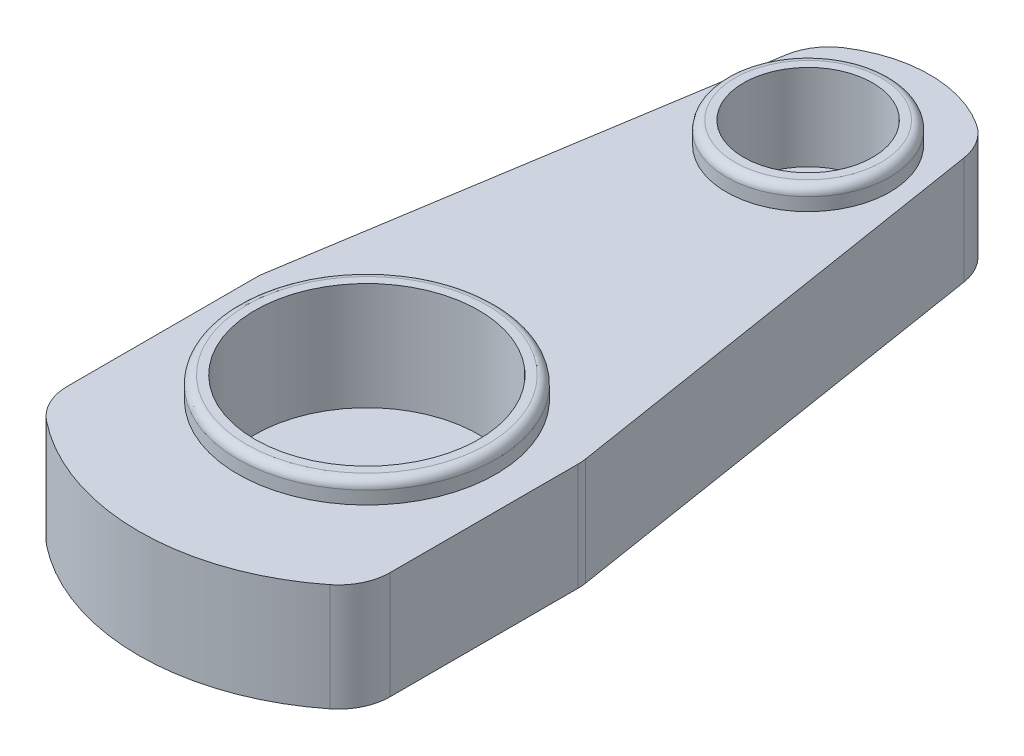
ISO-10303-21;
HEADER;
FILE_DESCRIPTION(('STEP AP214'),'2;1');
FILE_NAME('part.step','',(''),(''),'','','');
FILE_SCHEMA(('AUTOMOTIVE_DESIGN { 1 0 10303 214 1 1 1 1 }'));
ENDSEC;
DATA;
#1=APPLICATION_CONTEXT('core data for automotive mechanical design processes');
#2=APPLICATION_PROTOCOL_DEFINITION('international standard','automotive_design',2000,#1);
#3=PRODUCT_CONTEXT('',#1,'mechanical');
#4=PRODUCT('Part','Part','',(#3));
#5=PRODUCT_RELATED_PRODUCT_CATEGORY('part','',(#4));
#6=PRODUCT_DEFINITION_FORMATION('','',#4);
#7=PRODUCT_DEFINITION_CONTEXT('part definition',#1,'design');
#8=PRODUCT_DEFINITION('design','',#6,#7);
#9=PRODUCT_DEFINITION_SHAPE('','',#8);
#10=(LENGTH_UNIT() NAMED_UNIT(*) SI_UNIT(.MILLI.,.METRE.));
#11=(NAMED_UNIT(*) PLANE_ANGLE_UNIT() SI_UNIT($,.RADIAN.));
#12=(NAMED_UNIT(*) SI_UNIT($,.STERADIAN.) SOLID_ANGLE_UNIT());
#13=UNCERTAINTY_MEASURE_WITH_UNIT(LENGTH_MEASURE(1.E-05),#10,'distance_accuracy_value','');
#14=(GEOMETRIC_REPRESENTATION_CONTEXT(3) GLOBAL_UNCERTAINTY_ASSIGNED_CONTEXT((#13)) GLOBAL_UNIT_ASSIGNED_CONTEXT((#10,
#11,#12)) REPRESENTATION_CONTEXT('',''));
#15=CARTESIAN_POINT('',(0.,0.,0.));
#16=DIRECTION('',(0.,0.,1.));
#17=DIRECTION('',(1.,0.,0.));
#18=AXIS2_PLACEMENT_3D('',#15,#16,#17);
#19=CARTESIAN_POINT('',(0.,25.,37.546695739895));
#20=DIRECTION('',(0.,-1.,0.));
#21=DIRECTION('',(0.,0.,-1.));
#22=AXIS2_PLACEMENT_3D('',#19,#20,#21);
#23=CYLINDRICAL_SURFACE('',#22,53.);
#24=CARTESIAN_POINT('',(0.,25.,37.546695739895));
#25=DIRECTION('',(0.,1.,0.));
#26=DIRECTION('',(0.,0.,-1.));
#27=AXIS2_PLACEMENT_3D('',#24,#25,#26);
#28=CIRCLE('',#27,53.);
#29=CARTESIAN_POINT('',(-32.9634146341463,25.,79.0486631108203));
#30=VERTEX_POINT('',#29);
#31=CARTESIAN_POINT('',(32.9634146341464,25.,79.0486631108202));
#32=VERTEX_POINT('',#31);
#33=EDGE_CURVE('E156',#30,#32,#28,.T.);
#34=ORIENTED_EDGE('',*,*,#33,.F.);
#35=DIRECTION('',(0.,-1.,0.));
#36=VECTOR('',#35,1.);
#37=CARTESIAN_POINT('',(-32.9634146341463,25.,79.0486631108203));
#38=LINE('',#37,#36);
#39=CARTESIAN_POINT('',(-32.9634146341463,0.,79.0486631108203));
#40=VERTEX_POINT('',#39);
#41=EDGE_CURVE('E11',#30,#40,#38,.T.);
#42=ORIENTED_EDGE('',*,*,#41,.T.);
#43=CARTESIAN_POINT('',(0.,0.,37.546695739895));
#44=DIRECTION('',(0.,1.,0.));
#45=DIRECTION('',(0.,0.,-1.));
#46=AXIS2_PLACEMENT_3D('',#43,#44,#45);
#47=CIRCLE('',#46,53.);
#48=CARTESIAN_POINT('',(32.9634146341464,0.,79.0486631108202));
#49=VERTEX_POINT('',#48);
#50=EDGE_CURVE('E223',#40,#49,#47,.T.);
#51=ORIENTED_EDGE('',*,*,#50,.T.);
#52=DIRECTION('',(0.,-1.,0.));
#53=VECTOR('',#52,1.);
#54=CARTESIAN_POINT('',(32.9634146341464,25.,79.0486631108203));
#55=LINE('',#54,#53);
#56=EDGE_CURVE('E44',#49,#32,#55,.F.);
#57=ORIENTED_EDGE('',*,*,#56,.T.);
#58=EDGE_LOOP('',(#34,#42,#51,#57));
#59=FACE_BOUND('',#58,.T.);
#60=ADVANCED_FACE('F36',(#59),#23,.T.);
#61=CARTESIAN_POINT('',(37.5,25.,75.));
#62=DIRECTION('',(-1.,0.,0.));
#63=DIRECTION('',(0.,0.,1.));
#64=AXIS2_PLACEMENT_3D('',#61,#62,#63);
#65=PLANE('',#64);
#66=DIRECTION('',(0.,0.,-1.));
#67=VECTOR('',#66,1.);
#68=CARTESIAN_POINT('',(37.5,0.,75.));
#69=LINE('',#68,#67);
#70=CARTESIAN_POINT('',(37.5,0.,69.6519912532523));
#71=VERTEX_POINT('',#70);
#72=CARTESIAN_POINT('',(37.5,0.,25.9485808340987));
#73=VERTEX_POINT('',#72);
#74=EDGE_CURVE('E238',#71,#73,#69,.T.);
#75=ORIENTED_EDGE('',*,*,#74,.T.);
#76=DIRECTION('',(0.,-1.,0.));
#77=VECTOR('',#76,1.);
#78=CARTESIAN_POINT('',(37.5,25.,25.9485808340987));
#79=LINE('',#78,#77);
#80=CARTESIAN_POINT('',(37.5,25.,25.9485808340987));
#81=VERTEX_POINT('',#80);
#82=EDGE_CURVE('E211',#73,#81,#79,.F.);
#83=ORIENTED_EDGE('',*,*,#82,.T.);
#84=DIRECTION('',(0.,0.,-1.));
#85=VECTOR('',#84,1.);
#86=CARTESIAN_POINT('',(37.5,25.,75.));
#87=LINE('',#86,#85);
#88=CARTESIAN_POINT('',(37.5,25.,69.6519912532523));
#89=VERTEX_POINT('',#88);
#90=EDGE_CURVE('E231',#89,#81,#87,.T.);
#91=ORIENTED_EDGE('',*,*,#90,.F.);
#92=DIRECTION('',(0.,-1.,0.));
#93=VECTOR('',#92,1.);
#94=CARTESIAN_POINT('',(37.5,25.,69.6519912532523));
#95=LINE('',#94,#93);
#96=EDGE_CURVE('E208',#89,#71,#95,.T.);
#97=ORIENTED_EDGE('',*,*,#96,.T.);
#98=EDGE_LOOP('',(#75,#83,#91,#97));
#99=FACE_BOUND('',#98,.T.);
#100=ADVANCED_FACE('F237',(#99),#65,.F.);
#101=CARTESIAN_POINT('',(37.5,25.,25.));
#102=DIRECTION('',(-0.987580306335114,0.,0.157115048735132));
#103=DIRECTION('',(0.157115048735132,0.,0.987580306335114));
#104=AXIS2_PLACEMENT_3D('',#101,#102,#103);
#105=PLANE('',#104);
#106=DIRECTION('',(-0.157115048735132,0.,-0.987580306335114));
#107=VECTOR('',#106,1.);
#108=CARTESIAN_POINT('',(37.5,0.,25.));
#109=LINE('',#108,#107);
#110=CARTESIAN_POINT('',(37.3509636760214,0.,24.0632002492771));
#111=VERTEX_POINT('',#110);
#112=CARTESIAN_POINT('',(20.7078936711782,0.,-80.5503826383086));
#113=VERTEX_POINT('',#112);
#114=EDGE_CURVE('E158',#111,#113,#109,.T.);
#115=ORIENTED_EDGE('',*,*,#114,.T.);
#116=DIRECTION('',(0.,-1.,0.));
#117=VECTOR('',#116,1.);
#118=CARTESIAN_POINT('',(20.7078936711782,25.,-80.5503826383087));
#119=LINE('',#118,#117);
#120=CARTESIAN_POINT('',(20.7078936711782,25.,-80.5503826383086));
#121=VERTEX_POINT('',#120);
#122=EDGE_CURVE('E206',#113,#121,#119,.F.);
#123=ORIENTED_EDGE('',*,*,#122,.T.);
#124=DIRECTION('',(-0.157115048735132,0.,-0.987580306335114));
#125=VECTOR('',#124,1.);
#126=CARTESIAN_POINT('',(37.5,25.,25.));
#127=LINE('',#126,#125);
#128=CARTESIAN_POINT('',(37.3509636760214,25.,24.0632002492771));
#129=VERTEX_POINT('',#128);
#130=EDGE_CURVE('E250',#129,#121,#127,.T.);
#131=ORIENTED_EDGE('',*,*,#130,.F.);
#132=DIRECTION('',(0.,-1.,0.));
#133=VECTOR('',#132,1.);
#134=CARTESIAN_POINT('',(37.3509636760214,25.,24.0632002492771));
#135=LINE('',#134,#133);
#136=EDGE_CURVE('E203',#129,#111,#135,.T.);
#137=ORIENTED_EDGE('',*,*,#136,.T.);
#138=EDGE_LOOP('',(#115,#123,#131,#137));
#139=FACE_BOUND('',#138,.T.);
#140=ADVANCED_FACE('F290',(#139),#105,.F.);
#141=CARTESIAN_POINT('',(0.,25.,-64.9999999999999));
#142=DIRECTION('',(0.,-1.,0.));
#143=DIRECTION('',(0.,0.,-1.));
#144=AXIS2_PLACEMENT_3D('',#141,#142,#143);
#145=CYLINDRICAL_SURFACE('',#144,28.284271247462);
#146=CARTESIAN_POINT('',(0.,0.,-64.9999999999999));
#147=DIRECTION('',(0.,1.,0.));
#148=DIRECTION('',(0.,0.,1.));
#149=AXIS2_PLACEMENT_3D('',#146,#147,#148);
#150=CIRCLE('',#149,28.284271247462);
#151=CARTESIAN_POINT('',(15.3836672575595,0.,-88.7348431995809));
#152=VERTEX_POINT('',#151);
#153=CARTESIAN_POINT('',(-15.3836672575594,0.,-88.7348431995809));
#154=VERTEX_POINT('',#153);
#155=EDGE_CURVE('E154',#152,#154,#150,.T.);
#156=ORIENTED_EDGE('',*,*,#155,.T.);
#157=DIRECTION('',(0.,-1.,0.));
#158=VECTOR('',#157,1.);
#159=CARTESIAN_POINT('',(-15.3836672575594,25.,-88.7348431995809));
#160=LINE('',#159,#158);
#161=CARTESIAN_POINT('',(-15.3836672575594,25.,-88.7348431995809));
#162=VERTEX_POINT('',#161);
#163=EDGE_CURVE('E132',#154,#162,#160,.F.);
#164=ORIENTED_EDGE('',*,*,#163,.T.);
#165=CARTESIAN_POINT('',(0.,25.,-64.9999999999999));
#166=DIRECTION('',(0.,1.,0.));
#167=DIRECTION('',(0.,0.,1.));
#168=AXIS2_PLACEMENT_3D('',#165,#166,#167);
#169=CIRCLE('',#168,28.284271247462);
#170=CARTESIAN_POINT('',(15.3836672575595,25.,-88.7348431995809));
#171=VERTEX_POINT('',#170);
#172=EDGE_CURVE('E248',#171,#162,#169,.T.);
#173=ORIENTED_EDGE('',*,*,#172,.F.);
#174=DIRECTION('',(0.,-1.,0.));
#175=VECTOR('',#174,1.);
#176=CARTESIAN_POINT('',(15.3836672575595,25.,-88.7348431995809));
#177=LINE('',#176,#175);
#178=EDGE_CURVE('E137',#171,#152,#177,.T.);
#179=ORIENTED_EDGE('',*,*,#178,.T.);
#180=EDGE_LOOP('',(#156,#164,#173,#179));
#181=FACE_BOUND('',#180,.T.);
#182=ADVANCED_FACE('F327',(#181),#145,.T.);
#183=CARTESIAN_POINT('',(-37.5,25.,25.));
#184=DIRECTION('',(0.987580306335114,0.,0.157115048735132));
#185=DIRECTION('',(0.157115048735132,0.,-0.987580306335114));
#186=AXIS2_PLACEMENT_3D('',#183,#184,#185);
#187=PLANE('',#186);
#188=DIRECTION('',(-0.157115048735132,0.,0.987580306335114));
#189=VECTOR('',#188,1.);
#190=CARTESIAN_POINT('',(-37.5,25.,25.));
#191=LINE('',#190,#189);
#192=CARTESIAN_POINT('',(-20.7078936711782,25.,-80.5503826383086));
#193=VERTEX_POINT('',#192);
#194=CARTESIAN_POINT('',(-37.3509636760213,25.,24.0632002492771));
#195=VERTEX_POINT('',#194);
#196=EDGE_CURVE('E146',#193,#195,#191,.T.);
#197=ORIENTED_EDGE('',*,*,#196,.F.);
#198=DIRECTION('',(0.,-1.,0.));
#199=VECTOR('',#198,1.);
#200=CARTESIAN_POINT('',(-20.7078936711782,25.,-80.5503826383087));
#201=LINE('',#200,#199);
#202=CARTESIAN_POINT('',(-20.7078936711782,0.,-80.5503826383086));
#203=VERTEX_POINT('',#202);
#204=EDGE_CURVE('E131',#193,#203,#201,.T.);
#205=ORIENTED_EDGE('',*,*,#204,.T.);
#206=DIRECTION('',(-0.157115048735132,0.,0.987580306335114));
#207=VECTOR('',#206,1.);
#208=CARTESIAN_POINT('',(-37.5,0.,25.));
#209=LINE('',#208,#207);
#210=CARTESIAN_POINT('',(-37.3509636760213,0.,24.0632002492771));
#211=VERTEX_POINT('',#210);
#212=EDGE_CURVE('E144',#203,#211,#209,.T.);
#213=ORIENTED_EDGE('',*,*,#212,.T.);
#214=DIRECTION('',(0.,-1.,0.));
#215=VECTOR('',#214,1.);
#216=CARTESIAN_POINT('',(-37.3509636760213,25.,24.0632002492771));
#217=LINE('',#216,#215);
#218=EDGE_CURVE('E148',#211,#195,#217,.F.);
#219=ORIENTED_EDGE('',*,*,#218,.T.);
#220=EDGE_LOOP('',(#197,#205,#213,#219));
#221=FACE_BOUND('',#220,.T.);
#222=ADVANCED_FACE('F143',(#221),#187,.F.);
#223=CARTESIAN_POINT('',(-37.5,25.,75.));
#224=DIRECTION('',(1.,0.,0.));
#225=DIRECTION('',(0.,0.,-1.));
#226=AXIS2_PLACEMENT_3D('',#223,#224,#225);
#227=PLANE('',#226);
#228=DIRECTION('',(0.,0.,1.));
#229=VECTOR('',#228,1.);
#230=CARTESIAN_POINT('',(-37.5,25.,75.));
#231=LINE('',#230,#229);
#232=CARTESIAN_POINT('',(-37.5,25.,25.9485808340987));
#233=VERTEX_POINT('',#232);
#234=CARTESIAN_POINT('',(-37.5,25.,69.6519912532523));
#235=VERTEX_POINT('',#234);
#236=EDGE_CURVE('E166',#233,#235,#231,.T.);
#237=ORIENTED_EDGE('',*,*,#236,.F.);
#238=DIRECTION('',(0.,-1.,0.));
#239=VECTOR('',#238,1.);
#240=CARTESIAN_POINT('',(-37.5,25.,25.9485808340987));
#241=LINE('',#240,#239);
#242=CARTESIAN_POINT('',(-37.5,0.,25.9485808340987));
#243=VERTEX_POINT('',#242);
#244=EDGE_CURVE('E214',#233,#243,#241,.T.);
#245=ORIENTED_EDGE('',*,*,#244,.T.);
#246=DIRECTION('',(0.,0.,1.));
#247=VECTOR('',#246,1.);
#248=CARTESIAN_POINT('',(-37.5,0.,75.));
#249=LINE('',#248,#247);
#250=CARTESIAN_POINT('',(-37.5,0.,69.6519912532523));
#251=VERTEX_POINT('',#250);
#252=EDGE_CURVE('E153',#243,#251,#249,.T.);
#253=ORIENTED_EDGE('',*,*,#252,.T.);
#254=DIRECTION('',(0.,-1.,0.));
#255=VECTOR('',#254,1.);
#256=CARTESIAN_POINT('',(-37.5,25.,69.6519912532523));
#257=LINE('',#256,#255);
#258=EDGE_CURVE('E51',#251,#235,#257,.F.);
#259=ORIENTED_EDGE('',*,*,#258,.T.);
#260=EDGE_LOOP('',(#237,#245,#253,#259));
#261=FACE_BOUND('',#260,.T.);
#262=ADVANCED_FACE('F321',(#261),#227,.F.);
#263=CARTESIAN_POINT('',(0.,25.,37.546695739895));
#264=DIRECTION('',(0.,-1.,0.));
#265=DIRECTION('',(0.,0.,-1.));
#266=AXIS2_PLACEMENT_3D('',#263,#264,#265);
#267=PLANE('',#266);
#268=CARTESIAN_POINT('',(0.,25.,-64.9999999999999));
#269=DIRECTION('',(0.,-1.,0.));
#270=DIRECTION('',(0.,0.,-1.));
#271=AXIS2_PLACEMENT_3D('',#268,#269,#270);
#272=CIRCLE('',#271,19.);
#273=CARTESIAN_POINT('',(0.,25.,-83.9999999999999));
#274=VERTEX_POINT('',#273);
#275=EDGE_CURVE('E172',#274,#274,#272,.F.);
#276=ORIENTED_EDGE('',*,*,#275,.F.);
#277=EDGE_LOOP('',(#276));
#278=FACE_BOUND('',#277,.T.);
#279=CARTESIAN_POINT('',(0.,25.,37.546695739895));
#280=DIRECTION('',(0.,-1.,0.));
#281=DIRECTION('',(0.,0.,-1.));
#282=AXIS2_PLACEMENT_3D('',#279,#280,#281);
#283=CIRCLE('',#282,30.);
#284=CARTESIAN_POINT('',(0.,25.,7.54669573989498));
#285=VERTEX_POINT('',#284);
#286=EDGE_CURVE('E162',#285,#285,#283,.F.);
#287=ORIENTED_EDGE('',*,*,#286,.F.);
#288=EDGE_LOOP('',(#287));
#289=FACE_BOUND('',#288,.T.);
#290=ORIENTED_EDGE('',*,*,#172,.T.);
#291=CARTESIAN_POINT('',(-8.85692999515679,25.,-78.6650020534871));
#292=DIRECTION('',(0.,-1.,0.));
#293=DIRECTION('',(0.,0.,-1.));
#294=AXIS2_PLACEMENT_3D('',#291,#292,#293);
#295=CIRCLE('',#294,12.);
#296=EDGE_CURVE('E201',#162,#193,#295,.F.);
#297=ORIENTED_EDGE('',*,*,#296,.T.);
#298=ORIENTED_EDGE('',*,*,#196,.T.);
#299=CARTESIAN_POINT('',(-25.5,25.,25.9485808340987));
#300=DIRECTION('',(0.,-1.,0.));
#301=DIRECTION('',(0.,0.,-1.));
#302=AXIS2_PLACEMENT_3D('',#299,#300,#301);
#303=CIRCLE('',#302,12.);
#304=EDGE_CURVE('E58',#195,#233,#303,.F.);
#305=ORIENTED_EDGE('',*,*,#304,.T.);
#306=ORIENTED_EDGE('',*,*,#236,.T.);
#307=CARTESIAN_POINT('',(-25.5,25.,69.6519912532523));
#308=DIRECTION('',(0.,-1.,0.));
#309=DIRECTION('',(0.,0.,-1.));
#310=AXIS2_PLACEMENT_3D('',#307,#308,#309);
#311=CIRCLE('',#310,12.);
#312=EDGE_CURVE('E194',#235,#30,#311,.F.);
#313=ORIENTED_EDGE('',*,*,#312,.T.);
#314=ORIENTED_EDGE('',*,*,#33,.T.);
#315=CARTESIAN_POINT('',(25.5,25.,69.6519912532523));
#316=DIRECTION('',(0.,-1.,0.));
#317=DIRECTION('',(0.,0.,-1.));
#318=AXIS2_PLACEMENT_3D('',#315,#316,#317);
#319=CIRCLE('',#318,12.);
#320=EDGE_CURVE('E192',#32,#89,#319,.F.);
#321=ORIENTED_EDGE('',*,*,#320,.T.);
#322=ORIENTED_EDGE('',*,*,#90,.T.);
#323=CARTESIAN_POINT('',(25.5,25.,25.9485808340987));
#324=DIRECTION('',(0.,-1.,0.));
#325=DIRECTION('',(0.,0.,-1.));
#326=AXIS2_PLACEMENT_3D('',#323,#324,#325);
#327=CIRCLE('',#326,12.);
#328=EDGE_CURVE('E197',#81,#129,#327,.F.);
#329=ORIENTED_EDGE('',*,*,#328,.T.);
#330=ORIENTED_EDGE('',*,*,#130,.T.);
#331=CARTESIAN_POINT('',(8.85692999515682,25.,-78.6650020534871));
#332=DIRECTION('',(0.,-1.,0.));
#333=DIRECTION('',(0.,0.,-1.));
#334=AXIS2_PLACEMENT_3D('',#331,#332,#333);
#335=CIRCLE('',#334,12.);
#336=EDGE_CURVE('E199',#121,#171,#335,.F.);
#337=ORIENTED_EDGE('',*,*,#336,.T.);
#338=EDGE_LOOP('',(#290,#297,#298,#305,#306,#313,#314,#321,#322,#329,#330,#337));
#339=FACE_BOUND('',#338,.T.);
#340=ADVANCED_FACE('F227',(#278,#289,#339),#267,.F.);
#341=CARTESIAN_POINT('',(0.,0.,37.546695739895));
#342=DIRECTION('',(0.,-1.,0.));
#343=DIRECTION('',(0.,0.,-1.));
#344=AXIS2_PLACEMENT_3D('',#341,#342,#343);
#345=PLANE('',#344);
#346=ORIENTED_EDGE('',*,*,#212,.F.);
#347=CARTESIAN_POINT('',(-8.85692999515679,0.,-78.6650020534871));
#348=DIRECTION('',(0.,-1.,0.));
#349=DIRECTION('',(0.,0.,-1.));
#350=AXIS2_PLACEMENT_3D('',#347,#348,#349);
#351=CIRCLE('',#350,12.);
#352=EDGE_CURVE('E127',#203,#154,#351,.T.);
#353=ORIENTED_EDGE('',*,*,#352,.T.);
#354=ORIENTED_EDGE('',*,*,#155,.F.);
#355=CARTESIAN_POINT('',(8.85692999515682,0.,-78.6650020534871));
#356=DIRECTION('',(0.,-1.,0.));
#357=DIRECTION('',(0.,0.,-1.));
#358=AXIS2_PLACEMENT_3D('',#355,#356,#357);
#359=CIRCLE('',#358,12.);
#360=EDGE_CURVE('E138',#152,#113,#359,.T.);
#361=ORIENTED_EDGE('',*,*,#360,.T.);
#362=ORIENTED_EDGE('',*,*,#114,.F.);
#363=CARTESIAN_POINT('',(25.5,0.,25.9485808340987));
#364=DIRECTION('',(0.,-1.,0.));
#365=DIRECTION('',(0.,0.,-1.));
#366=AXIS2_PLACEMENT_3D('',#363,#364,#365);
#367=CIRCLE('',#366,12.);
#368=EDGE_CURVE('E186',#111,#73,#367,.T.);
#369=ORIENTED_EDGE('',*,*,#368,.T.);
#370=ORIENTED_EDGE('',*,*,#74,.F.);
#371=CARTESIAN_POINT('',(25.5,0.,69.6519912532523));
#372=DIRECTION('',(0.,-1.,0.));
#373=DIRECTION('',(0.,0.,-1.));
#374=AXIS2_PLACEMENT_3D('',#371,#372,#373);
#375=CIRCLE('',#374,12.);
#376=EDGE_CURVE('E147',#71,#49,#375,.T.);
#377=ORIENTED_EDGE('',*,*,#376,.T.);
#378=ORIENTED_EDGE('',*,*,#50,.F.);
#379=CARTESIAN_POINT('',(-25.5,0.,69.6519912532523));
#380=DIRECTION('',(0.,-1.,0.));
#381=DIRECTION('',(0.,0.,-1.));
#382=AXIS2_PLACEMENT_3D('',#379,#380,#381);
#383=CIRCLE('',#382,12.);
#384=EDGE_CURVE('E183',#40,#251,#383,.T.);
#385=ORIENTED_EDGE('',*,*,#384,.T.);
#386=ORIENTED_EDGE('',*,*,#252,.F.);
#387=CARTESIAN_POINT('',(-25.5,0.,25.9485808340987));
#388=DIRECTION('',(0.,-1.,0.));
#389=DIRECTION('',(0.,0.,-1.));
#390=AXIS2_PLACEMENT_3D('',#387,#388,#389);
#391=CIRCLE('',#390,12.);
#392=EDGE_CURVE('E152',#243,#211,#391,.T.);
#393=ORIENTED_EDGE('',*,*,#392,.T.);
#394=EDGE_LOOP('',(#346,#353,#354,#361,#362,#369,#370,#377,#378,#385,#386,#393));
#395=FACE_BOUND('',#394,.T.);
#396=ADVANCED_FACE('F150',(#395),#345,.T.);
#397=CARTESIAN_POINT('',(0.,30.,37.546695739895));
#398=DIRECTION('',(0.,-1.,0.));
#399=DIRECTION('',(0.,0.,-1.));
#400=AXIS2_PLACEMENT_3D('',#397,#398,#399);
#401=CYLINDRICAL_SURFACE('',#400,30.);
#402=CARTESIAN_POINT('',(0.,28.,37.546695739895));
#403=DIRECTION('',(0.,1.,0.));
#404=DIRECTION('',(0.,0.,1.));
#405=AXIS2_PLACEMENT_3D('',#402,#403,#404);
#406=CIRCLE('',#405,30.);
#407=CARTESIAN_POINT('',(0.,28.,67.546695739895));
#408=VERTEX_POINT('',#407);
#409=EDGE_CURVE('E169',#408,#408,#406,.F.);
#410=ORIENTED_EDGE('',*,*,#409,.T.);
#411=EDGE_LOOP('',(#410));
#412=FACE_BOUND('',#411,.T.);
#413=ORIENTED_EDGE('',*,*,#286,.T.);
#414=EDGE_LOOP('',(#413));
#415=FACE_BOUND('',#414,.T.);
#416=ADVANCED_FACE('F345',(#412,#415),#401,.T.);
#417=CARTESIAN_POINT('',(0.,30.,37.546695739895));
#418=DIRECTION('',(0.,1.,0.));
#419=DIRECTION('',(0.,0.,1.));
#420=AXIS2_PLACEMENT_3D('',#417,#418,#419);
#421=PLANE('',#420);
#422=CARTESIAN_POINT('',(0.,30.,37.546695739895));
#423=DIRECTION('',(0.,1.,0.));
#424=DIRECTION('',(0.,0.,1.));
#425=AXIS2_PLACEMENT_3D('',#422,#423,#424);
#426=CIRCLE('',#425,28.);
#427=CARTESIAN_POINT('',(0.,30.,65.546695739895));
#428=VERTEX_POINT('',#427);
#429=EDGE_CURVE('E165',#428,#428,#426,.T.);
#430=ORIENTED_EDGE('',*,*,#429,.T.);
#431=EDGE_LOOP('',(#430));
#432=FACE_BOUND('',#431,.T.);
#433=CARTESIAN_POINT('',(0.,30.,37.546695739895));
#434=DIRECTION('',(0.,1.,0.));
#435=DIRECTION('',(0.,0.,1.));
#436=AXIS2_PLACEMENT_3D('',#433,#434,#435);
#437=CIRCLE('',#436,26.);
#438=CARTESIAN_POINT('',(0.,30.,63.546695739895));
#439=VERTEX_POINT('',#438);
#440=EDGE_CURVE('E254',#439,#439,#437,.T.);
#441=ORIENTED_EDGE('',*,*,#440,.F.);
#442=EDGE_LOOP('',(#441));
#443=FACE_BOUND('',#442,.T.);
#444=ADVANCED_FACE('F351',(#432,#443),#421,.T.);
#445=CARTESIAN_POINT('',(0.,5.,37.546695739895));
#446=DIRECTION('',(0.,1.,0.));
#447=DIRECTION('',(0.,0.,1.));
#448=AXIS2_PLACEMENT_3D('',#445,#446,#447);
#449=CYLINDRICAL_SURFACE('',#448,26.);
#450=CARTESIAN_POINT('',(0.,5.,37.546695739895));
#451=DIRECTION('',(0.,1.,0.));
#452=DIRECTION('',(0.,0.,1.));
#453=AXIS2_PLACEMENT_3D('',#450,#451,#452);
#454=CIRCLE('',#453,26.);
#455=CARTESIAN_POINT('',(0.,5.,63.546695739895));
#456=VERTEX_POINT('',#455);
#457=EDGE_CURVE('E243',#456,#456,#454,.T.);
#458=ORIENTED_EDGE('',*,*,#457,.F.);
#459=EDGE_LOOP('',(#458));
#460=FACE_BOUND('',#459,.T.);
#461=ORIENTED_EDGE('',*,*,#440,.T.);
#462=EDGE_LOOP('',(#461));
#463=FACE_BOUND('',#462,.T.);
#464=ADVANCED_FACE('F355',(#460,#463),#449,.F.);
#465=CARTESIAN_POINT('',(0.,5.,37.546695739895));
#466=DIRECTION('',(0.,1.,0.));
#467=DIRECTION('',(0.,0.,1.));
#468=AXIS2_PLACEMENT_3D('',#465,#466,#467);
#469=PLANE('',#468);
#470=ORIENTED_EDGE('',*,*,#457,.T.);
#471=EDGE_LOOP('',(#470));
#472=FACE_BOUND('',#471,.T.);
#473=ADVANCED_FACE('F296',(#472),#469,.T.);
#474=CARTESIAN_POINT('',(0.,28.,37.546695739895));
#475=DIRECTION('',(0.,1.,0.));
#476=DIRECTION('',(0.,0.,1.));
#477=AXIS2_PLACEMENT_3D('',#474,#475,#476);
#478=TOROIDAL_SURFACE('',#477,28.,2.);
#479=ORIENTED_EDGE('',*,*,#409,.F.);
#480=EDGE_LOOP('',(#479));
#481=FACE_BOUND('',#480,.T.);
#482=ORIENTED_EDGE('',*,*,#429,.F.);
#483=EDGE_LOOP('',(#482));
#484=FACE_BOUND('',#483,.T.);
#485=ADVANCED_FACE('F282',(#481,#484),#478,.T.);
#486=CARTESIAN_POINT('',(0.,30.,-64.9999999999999));
#487=DIRECTION('',(0.,-1.,0.));
#488=DIRECTION('',(0.,0.,-1.));
#489=AXIS2_PLACEMENT_3D('',#486,#487,#488);
#490=CYLINDRICAL_SURFACE('',#489,19.);
#491=CARTESIAN_POINT('',(0.,28.,-64.9999999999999));
#492=DIRECTION('',(0.,1.,0.));
#493=DIRECTION('',(0.,0.,1.));
#494=AXIS2_PLACEMENT_3D('',#491,#492,#493);
#495=CIRCLE('',#494,19.);
#496=CARTESIAN_POINT('',(0.,28.,-45.9999999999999));
#497=VERTEX_POINT('',#496);
#498=EDGE_CURVE('E178',#497,#497,#495,.F.);
#499=ORIENTED_EDGE('',*,*,#498,.T.);
#500=EDGE_LOOP('',(#499));
#501=FACE_BOUND('',#500,.T.);
#502=ORIENTED_EDGE('',*,*,#275,.T.);
#503=EDGE_LOOP('',(#502));
#504=FACE_BOUND('',#503,.T.);
#505=ADVANCED_FACE('F276',(#501,#504),#490,.T.);
#506=CARTESIAN_POINT('',(0.,30.,-64.9999999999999));
#507=DIRECTION('',(0.,1.,0.));
#508=DIRECTION('',(0.,0.,1.));
#509=AXIS2_PLACEMENT_3D('',#506,#507,#508);
#510=PLANE('',#509);
#511=CARTESIAN_POINT('',(0.,30.,-64.9999999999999));
#512=DIRECTION('',(0.,1.,0.));
#513=DIRECTION('',(0.,0.,1.));
#514=AXIS2_PLACEMENT_3D('',#511,#512,#513);
#515=CIRCLE('',#514,17.);
#516=CARTESIAN_POINT('',(0.,30.,-47.9999999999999));
#517=VERTEX_POINT('',#516);
#518=EDGE_CURVE('E175',#517,#517,#515,.T.);
#519=ORIENTED_EDGE('',*,*,#518,.T.);
#520=EDGE_LOOP('',(#519));
#521=FACE_BOUND('',#520,.T.);
#522=CARTESIAN_POINT('',(0.,30.,-64.9999999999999));
#523=DIRECTION('',(0.,1.,0.));
#524=DIRECTION('',(0.,0.,1.));
#525=AXIS2_PLACEMENT_3D('',#522,#523,#524);
#526=CIRCLE('',#525,15.);
#527=CARTESIAN_POINT('',(0.,30.,-49.9999999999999));
#528=VERTEX_POINT('',#527);
#529=EDGE_CURVE('E260',#528,#528,#526,.T.);
#530=ORIENTED_EDGE('',*,*,#529,.F.);
#531=EDGE_LOOP('',(#530));
#532=FACE_BOUND('',#531,.T.);
#533=ADVANCED_FACE('F271',(#521,#532),#510,.T.);
#534=CARTESIAN_POINT('',(0.,10.,-64.9999999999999));
#535=DIRECTION('',(0.,1.,0.));
#536=DIRECTION('',(0.,0.,1.));
#537=AXIS2_PLACEMENT_3D('',#534,#535,#536);
#538=CYLINDRICAL_SURFACE('',#537,15.);
#539=CARTESIAN_POINT('',(0.,10.,-64.9999999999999));
#540=DIRECTION('',(0.,1.,0.));
#541=DIRECTION('',(0.,0.,1.));
#542=AXIS2_PLACEMENT_3D('',#539,#540,#541);
#543=CIRCLE('',#542,15.);
#544=CARTESIAN_POINT('',(0.,10.,-49.9999999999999));
#545=VERTEX_POINT('',#544);
#546=EDGE_CURVE('E257',#545,#545,#543,.T.);
#547=ORIENTED_EDGE('',*,*,#546,.F.);
#548=EDGE_LOOP('',(#547));
#549=FACE_BOUND('',#548,.T.);
#550=ORIENTED_EDGE('',*,*,#529,.T.);
#551=EDGE_LOOP('',(#550));
#552=FACE_BOUND('',#551,.T.);
#553=ADVANCED_FACE('F268',(#549,#552),#538,.F.);
#554=CARTESIAN_POINT('',(0.,10.,-64.9999999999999));
#555=DIRECTION('',(0.,1.,0.));
#556=DIRECTION('',(0.,0.,1.));
#557=AXIS2_PLACEMENT_3D('',#554,#555,#556);
#558=PLANE('',#557);
#559=ORIENTED_EDGE('',*,*,#546,.T.);
#560=EDGE_LOOP('',(#559));
#561=FACE_BOUND('',#560,.T.);
#562=ADVANCED_FACE('F266',(#561),#558,.T.);
#563=CARTESIAN_POINT('',(0.,28.,-64.9999999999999));
#564=DIRECTION('',(0.,1.,0.));
#565=DIRECTION('',(0.,0.,1.));
#566=AXIS2_PLACEMENT_3D('',#563,#564,#565);
#567=TOROIDAL_SURFACE('',#566,17.,2.);
#568=ORIENTED_EDGE('',*,*,#498,.F.);
#569=EDGE_LOOP('',(#568));
#570=FACE_BOUND('',#569,.T.);
#571=ORIENTED_EDGE('',*,*,#518,.F.);
#572=EDGE_LOOP('',(#571));
#573=FACE_BOUND('',#572,.T.);
#574=ADVANCED_FACE('F298',(#570,#573),#567,.T.);
#575=CARTESIAN_POINT('',(-8.85692999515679,25.,-78.6650020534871));
#576=DIRECTION('',(0.,-1.,0.));
#577=DIRECTION('',(0.,0.,-1.));
#578=AXIS2_PLACEMENT_3D('',#575,#576,#577);
#579=CYLINDRICAL_SURFACE('',#578,12.);
#580=ORIENTED_EDGE('',*,*,#296,.F.);
#581=ORIENTED_EDGE('',*,*,#163,.F.);
#582=ORIENTED_EDGE('',*,*,#352,.F.);
#583=ORIENTED_EDGE('',*,*,#204,.F.);
#584=EDGE_LOOP('',(#580,#581,#582,#583));
#585=FACE_BOUND('',#584,.T.);
#586=ADVANCED_FACE('F130',(#585),#579,.T.);
#587=CARTESIAN_POINT('',(8.85692999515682,25.,-78.6650020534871));
#588=DIRECTION('',(0.,-1.,0.));
#589=DIRECTION('',(0.,0.,-1.));
#590=AXIS2_PLACEMENT_3D('',#587,#588,#589);
#591=CYLINDRICAL_SURFACE('',#590,12.);
#592=ORIENTED_EDGE('',*,*,#336,.F.);
#593=ORIENTED_EDGE('',*,*,#122,.F.);
#594=ORIENTED_EDGE('',*,*,#360,.F.);
#595=ORIENTED_EDGE('',*,*,#178,.F.);
#596=EDGE_LOOP('',(#592,#593,#594,#595));
#597=FACE_BOUND('',#596,.T.);
#598=ADVANCED_FACE('F304',(#597),#591,.T.);
#599=CARTESIAN_POINT('',(25.5,25.,25.9485808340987));
#600=DIRECTION('',(0.,-1.,0.));
#601=DIRECTION('',(0.,0.,-1.));
#602=AXIS2_PLACEMENT_3D('',#599,#600,#601);
#603=CYLINDRICAL_SURFACE('',#602,12.);
#604=ORIENTED_EDGE('',*,*,#328,.F.);
#605=ORIENTED_EDGE('',*,*,#82,.F.);
#606=ORIENTED_EDGE('',*,*,#368,.F.);
#607=ORIENTED_EDGE('',*,*,#136,.F.);
#608=EDGE_LOOP('',(#604,#605,#606,#607));
#609=FACE_BOUND('',#608,.T.);
#610=ADVANCED_FACE('F307',(#609),#603,.T.);
#611=CARTESIAN_POINT('',(-25.5,25.,25.9485808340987));
#612=DIRECTION('',(0.,-1.,0.));
#613=DIRECTION('',(0.,0.,-1.));
#614=AXIS2_PLACEMENT_3D('',#611,#612,#613);
#615=CYLINDRICAL_SURFACE('',#614,12.);
#616=ORIENTED_EDGE('',*,*,#304,.F.);
#617=ORIENTED_EDGE('',*,*,#218,.F.);
#618=ORIENTED_EDGE('',*,*,#392,.F.);
#619=ORIENTED_EDGE('',*,*,#244,.F.);
#620=EDGE_LOOP('',(#616,#617,#618,#619));
#621=FACE_BOUND('',#620,.T.);
#622=ADVANCED_FACE('F311',(#621),#615,.T.);
#623=CARTESIAN_POINT('',(-25.5,25.,69.6519912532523));
#624=DIRECTION('',(0.,-1.,0.));
#625=DIRECTION('',(0.,0.,-1.));
#626=AXIS2_PLACEMENT_3D('',#623,#624,#625);
#627=CYLINDRICAL_SURFACE('',#626,12.);
#628=ORIENTED_EDGE('',*,*,#312,.F.);
#629=ORIENTED_EDGE('',*,*,#258,.F.);
#630=ORIENTED_EDGE('',*,*,#384,.F.);
#631=ORIENTED_EDGE('',*,*,#41,.F.);
#632=EDGE_LOOP('',(#628,#629,#630,#631));
#633=FACE_BOUND('',#632,.T.);
#634=ADVANCED_FACE('F314',(#633),#627,.T.);
#635=CARTESIAN_POINT('',(25.5,25.,69.6519912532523));
#636=DIRECTION('',(0.,-1.,0.));
#637=DIRECTION('',(0.,0.,-1.));
#638=AXIS2_PLACEMENT_3D('',#635,#636,#637);
#639=CYLINDRICAL_SURFACE('',#638,12.);
#640=ORIENTED_EDGE('',*,*,#320,.F.);
#641=ORIENTED_EDGE('',*,*,#56,.F.);
#642=ORIENTED_EDGE('',*,*,#376,.F.);
#643=ORIENTED_EDGE('',*,*,#96,.F.);
#644=EDGE_LOOP('',(#640,#641,#642,#643));
#645=FACE_BOUND('',#644,.T.);
#646=ADVANCED_FACE('F38',(#645),#639,.T.);
#647=CLOSED_SHELL('',(#60,#100,#140,#182,#222,#262,#340,#396,#416,#444,#464,#473,#485,#505,#533,
#553,#562,#574,#586,#598,#610,#622,#634,#646));
#648=MANIFOLD_SOLID_BREP('B2',#647);
#649=ADVANCED_BREP_SHAPE_REPRESENTATION('',(#18,#648),#14);
#650=SHAPE_DEFINITION_REPRESENTATION(#9,#649);
ENDSEC;
END-ISO-10303-21;
